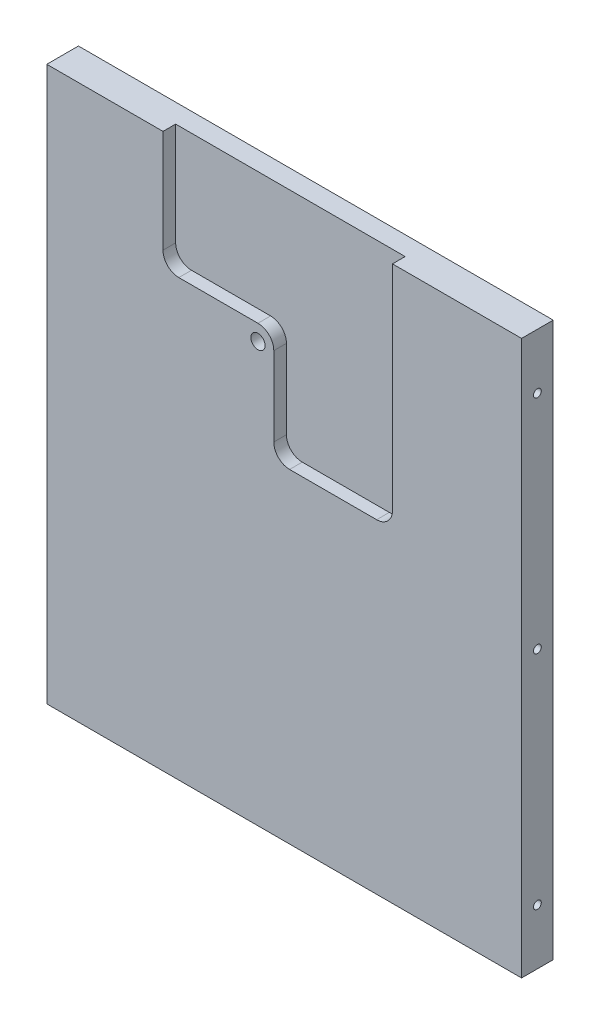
from build123d import *

# Parameters (mm, degrees)
SKIZZE1_W                       = 150
SKIZZE1_H                       = 175
AUFSATZ_LINEAR_AUSTRAGEN1_DEPTH = 10
SKIZZE2_R                       = 2.25
SCHNITT_LINEAR_AUSTRAGEN1_DEPTH = 10
SCHNITT_LINEAR_AUSTRAGEN2_DEPTH = 4
SKIZZE4_R                       = 1.23
SCHNITT_LINEAR_AUSTRAGEN3_DEPTH = 5
SCHNITT_LINEAR_START            = -5
SKIZZE6_R                       = 1.23
SCHNITT_LINEAR_AUSTRAGEN4_DEPTH = 5


with BuildPart() as part:
    # Skizze1 → Aufsatz-Linear austragen1 (new body)
    with BuildSketch(Plane.XY):
        with Locations((-21.140947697, -18.099765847)):
            Rectangle(SKIZZE1_W, SKIZZE1_H)
    extrude(amount=AUFSATZ_LINEAR_AUSTRAGEN1_DEPTH)

    # Skizze2 → Schnitt-Linear austragen1 (cut)
    with BuildSketch(Plane.XY.offset(10)):
        with Locations((-29.425704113, 26.900234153)):
            Circle(SKIZZE2_R)
    extrude(amount=-SCHNITT_LINEAR_AUSTRAGEN1_DEPTH, mode=Mode.SUBTRACT)

    # Skizze3 → Schnitt-Linear austragen2 (cut)
    with BuildSketch(Plane.XY.offset(10)):
        with BuildLine():
            Line((-54.425704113, 31.900234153), (-29.425704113, 31.900234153))
            ThreePointArc((-29.425704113, 31.900234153), (-25.890170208, 30.435768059), (-24.425704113, 26.900234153))
            Line((-24.425704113, 26.900234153), (-24.425704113, 1.900234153))
            ThreePointArc((-24.425704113, 1.900234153), (-22.961238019, -1.635299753), (-19.425704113, -3.099765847))
            Line((-19.425704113, -3.099765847), (8.074295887, -3.099765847))
            ThreePointArc((8.074295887, -3.099765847), (11.609829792, -1.635299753), (13.074295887, 1.900234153))
            Line((13.074295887, 1.900234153), (13.074295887, 69.400234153))
            Line((13.074295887, 69.400234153), (-59.425704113, 69.400234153))
            Line((-59.425704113, 69.400234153), (-59.425704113, 36.900234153))
            ThreePointArc((-59.425704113, 36.900234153), (-57.961238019, 33.364700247), (-54.425704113, 31.900234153))
        make_face()
    extrude(amount=-SCHNITT_LINEAR_AUSTRAGEN2_DEPTH, mode=Mode.SUBTRACT)

    # Skizze4 → Schnitt-Linear austragen3 (cut)
    with BuildSketch(Plane.ZY.offset(96.140947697)):
        with Locations(Location((5, 51.900234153, 0), (0, 0, 270))):
            Circle(SKIZZE4_R)
        with Locations(Location((5, -18.099765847, 0), (0, 0, 270))):
            Circle(SKIZZE4_R)
        with Locations(Location((5, -88.099765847, 0), (0, 0, 270))):
            Circle(SKIZZE4_R)
    extrude(amount=-SCHNITT_LINEAR_AUSTRAGEN3_DEPTH, mode=Mode.SUBTRACT)

    # Skizze6 → Schnitt-Linear austragen4 (cut)
    with BuildSketch(Plane(origin=(53.859052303, 0, 0), x_dir=(0, 0, -1), z_dir=(1, 0, 0)).offset(SCHNITT_LINEAR_START)):
        with Locations(Location((-5, 51.900234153, 0), (0, 0, 270))):
            Circle(SKIZZE6_R)
        with Locations(Location((-5, -18.099765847, 0), (0, 0, 270))):
            Circle(SKIZZE6_R)
        with Locations(Location((-5, -88.099765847, 0), (0, 0, 270))):
            Circle(SKIZZE6_R)
    extrude(amount=SCHNITT_LINEAR_AUSTRAGEN4_DEPTH, mode=Mode.SUBTRACT)


solid = part.part
